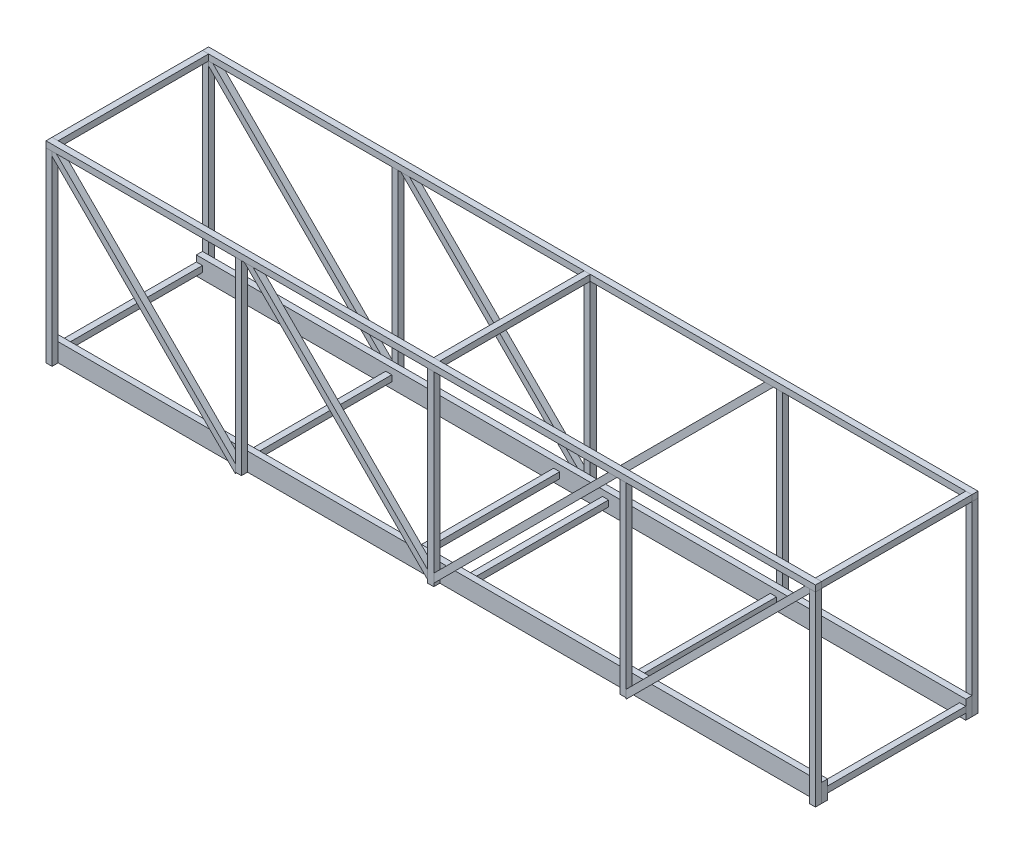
from build123d import *

# Parameters (mm, degrees)
SKETCH12_W                       = 3.175
SKETCH12_H                       = 9.525
STRUCTURAL_MEMBER1_DEPTH         = 400
SKETCH12_ON_SEGMENT_2_W          = 3.175
SKETCH12_ON_SEGMENT_2_H          = 9.525
STRUCTURAL_MEMBER1_2_DEPTH       = 400
SKETCH14_W                       = 3.175
SKETCH14_H                       = 3.175
STRUCTURAL_MEMBER2_DEPTH         = 75
SKETCH15_W                       = 3.175
SKETCH15_H                       = 3.175
STRUCTURAL_MEMBER3_DEPTH         = 75
SKETCH16_W                       = 3.175
SKETCH16_H                       = 3.175
STRUCTURAL_MEMBER4_DEPTH         = 75
SKETCH16_ON_SEGMENT_2_W          = 3.175
SKETCH16_ON_SEGMENT_2_H          = 3.175
STRUCTURAL_MEMBER4_2_DEPTH       = 75
SKETCH16_ON_SEGMENT_3_W          = 3.175
SKETCH16_ON_SEGMENT_3_H          = 3.175
STRUCTURAL_MEMBER4_3_DEPTH       = 75
SKETCH16_ON_SEGMENT_4_W          = 3.175
SKETCH16_ON_SEGMENT_4_H          = 3.175
STRUCTURAL_MEMBER4_4_DEPTH       = 75
SKETCH17_W                       = 3.175
SKETCH17_H                       = 3.175
STRUCTURAL_MEMBER5_DEPTH         = 100
SKETCH19_W                       = 3.175
SKETCH19_H                       = 3.175
STRUCTURAL_MEMBER6_DEPTH         = 100
SKETCH110_W                      = 3.175
SKETCH110_H                      = 3.175
STRUCTURAL_MEMBER7_DEPTH         = 100
SKETCH110_ON_SEGMENT_2_W         = 3.175
SKETCH110_ON_SEGMENT_2_H         = 3.175
STRUCTURAL_MEMBER7_2_DEPTH       = 100
SKETCH110_ON_SEGMENT_3_W         = 3.175
SKETCH110_ON_SEGMENT_3_H         = 3.175
STRUCTURAL_MEMBER7_3_DEPTH       = 100
SKETCH111_W                      = 3.175
SKETCH111_H                      = 3.175
STRUCTURAL_MEMBER8_DEPTH         = 400
SKETCH125_W                      = 3.175
SKETCH125_H                      = 3.175
STRUCTURAL_MEMBER15_DEPTH        = 100
SKETCH126_W                      = 3.175
SKETCH126_H                      = 3.175
STRUCTURAL_MEMBER16_DEPTH        = 100
SKETCH127_W                      = 3.175
SKETCH127_H                      = 3.175
STRUCTURAL_MEMBER17_DEPTH        = 100
SKETCH127_ON_SEGMENT_2_W         = 3.175
SKETCH127_ON_SEGMENT_2_H         = 3.175
STRUCTURAL_MEMBER17_2_DEPTH      = 100
SKETCH127_ON_SEGMENT_3_W         = 3.175
SKETCH127_ON_SEGMENT_3_H         = 3.175
STRUCTURAL_MEMBER17_3_DEPTH      = 100
SKETCH128_W                      = 3.175
SKETCH128_H                      = 3.175
STRUCTURAL_MEMBER18_DEPTH        = 400
SKETCH113_ON_SEGMENT_1_W         = 3.175
SKETCH113_ON_SEGMENT_1_H         = 3.175
STRUCTURAL_MEMBER9_DEPTH         = 142.421356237
SKETCH113_W                      = 3.175
SKETCH113_H                      = 3.175
STRUCTURAL_MEMBER9_2_DEPTH       = 141.421356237
BODY_START                       = 138.246356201
BODY_21_RUN_ON_DEPTH             = 76.130742
SKETCH130_ON_SEGMENT_1_W         = 3.175
SKETCH130_ON_SEGMENT_1_H         = 3.175
STRUCTURAL_MEMBER19_DEPTH        = 146.911484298
STRUCTURAL_MEMBER19_2_DEPTH      = 141.421356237
STRUCTURAL_MEMBER19_2_DEPTH_BACK = 5.490128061
SKETCH130_W                      = 3.175
SKETCH130_H                      = 3.175
SKETCH116_W                      = 3.175
SKETCH116_H                      = 3.175
STRUCTURAL_MEMBER10_DEPTH        = 141.421356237
BODY_25_RUN_ON_DEPTH             = 143.66642
SKETCH117_W                      = 3.175
SKETCH117_H                      = 3.175
STRUCTURAL_MEMBER11_DEPTH        = 141.421356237
SKETCH133_W                      = 3.175
SKETCH133_H                      = 3.175
STRUCTURAL_MEMBER21_DEPTH        = 141.421356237
BODY_27_RUN_ON_DEPTH             = 143.66642
SKETCH134_W                      = 3.175
SKETCH134_H                      = 3.175
STRUCTURAL_MEMBER22_DEPTH        = 141.421356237
SKETCH119_W                      = 3.175
SKETCH119_H                      = 3.175
STRUCTURAL_MEMBER12_DEPTH        = 78.175
SKETCH120_W                      = 3.175
SKETCH120_H                      = 3.175
STRUCTURAL_MEMBER13_DEPTH        = 78.175
SKETCH123_W                      = 3.175
SKETCH123_H                      = 3.175
STRUCTURAL_MEMBER14_DEPTH        = 78.175


with BuildPart() as part:
    # Sketch12 → Structural Member1 (new body)
    with BuildSketch(Plane(origin=(-200, 0, 37.5), x_dir=(0, 0, -1), z_dir=(1, 0, 0))):
        Rectangle(SKETCH12_W, SKETCH12_H)
    extrude(amount=STRUCTURAL_MEMBER1_DEPTH)


with BuildPart() as body_2:
    # Sketch12 on segment 2 (on carried to segment 2) → Structural Member1 2 (new body)
    with BuildSketch(Plane(origin=(-200, 0, -37.5), x_dir=(0, 0, -1), z_dir=(1, 0, 0))):
        Rectangle(SKETCH12_ON_SEGMENT_2_W, SKETCH12_ON_SEGMENT_2_H)
    extrude(amount=STRUCTURAL_MEMBER1_2_DEPTH)


with BuildPart() as body_3:
    # Sketch14 → Structural Member2 (new body)
    with BuildSketch(Plane(origin=(198.4125, 0, 37.5), x_dir=(-1, 0, 0), z_dir=(0, 0, -1))):
        Rectangle(SKETCH14_W, SKETCH14_H)
    extrude(amount=STRUCTURAL_MEMBER2_DEPTH)

    # Trim_Extend1 17: cut part
    add(part.part, mode=Mode.SUBTRACT)

    # Trim_Extend1 20
    split(bisect_by=Plane(origin=(0, 0, -35.9125), x_dir=(0, -1, 0), z_dir=(0, 0, 1)), keep=Keep.TOP)


with BuildPart() as body_4:
    # Sketch15 → Structural Member3 (new body)
    with BuildSketch(Plane(origin=(-198.4125, 0, 37.5), x_dir=(-1, 0, 0), z_dir=(0, 0, -1))):
        Rectangle(SKETCH15_W, SKETCH15_H)
    extrude(amount=STRUCTURAL_MEMBER3_DEPTH)

    # Trim_Extend1 17: cut part
    add(part.part, mode=Mode.SUBTRACT)

    # Trim_Extend1 34: cut body 2
    add(body_2.part, mode=Mode.SUBTRACT)


with BuildPart() as body_5:
    # Sketch16 → Structural Member4 (new body)
    with BuildSketch(Plane(origin=(-100, 0, -37.5), x_dir=(1, 0, 0), z_dir=(0, 0, 1))):
        Rectangle(SKETCH16_W, SKETCH16_H)
    extrude(amount=STRUCTURAL_MEMBER4_DEPTH)

    # Trim_Extend1
    split(bisect_by=Plane.YX.offset(-35.9125), keep=Keep.TOP)

    # Trim_Extend1 20
    split(bisect_by=Plane(origin=(0, 0, -35.9125), x_dir=(0, -1, 0), z_dir=(0, 0, 1)), keep=Keep.TOP)


with BuildPart() as body_6:
    # Sketch16 on segment 2 (on carried to segment 2) → Structural Member4 2 (new body)
    with BuildSketch(Plane(origin=(-12.7, 0, -37.5), x_dir=(1, 0, 0), z_dir=(0, 0, 1))):
        Rectangle(SKETCH16_ON_SEGMENT_2_W, SKETCH16_ON_SEGMENT_2_H)
    extrude(amount=STRUCTURAL_MEMBER4_2_DEPTH)

    # Trim_Extend1 17: cut part
    add(part.part, mode=Mode.SUBTRACT)

    # Trim_Extend1 34: cut body 2
    add(body_2.part, mode=Mode.SUBTRACT)


with BuildPart() as body_7:
    # Sketch16 on segment 3 (on carried to segment 3) → Structural Member4 3 (new body)
    with BuildSketch(Plane(origin=(12.7, 0, -37.5), x_dir=(1, 0, 0), z_dir=(0, 0, 1))):
        Rectangle(SKETCH16_ON_SEGMENT_3_W, SKETCH16_ON_SEGMENT_3_H)
    extrude(amount=STRUCTURAL_MEMBER4_3_DEPTH)

    # Trim_Extend1 17: cut part
    add(part.part, mode=Mode.SUBTRACT)

    # Trim_Extend1 34: cut body 2
    add(body_2.part, mode=Mode.SUBTRACT)


with BuildPart() as body_8:
    # Sketch16 on segment 4 (on carried to segment 4) → Structural Member4 4 (new body)
    with BuildSketch(Plane(origin=(100, 0, -37.5), x_dir=(1, 0, 0), z_dir=(0, 0, 1))):
        Rectangle(SKETCH16_ON_SEGMENT_4_W, SKETCH16_ON_SEGMENT_4_H)
    extrude(amount=STRUCTURAL_MEMBER4_4_DEPTH)

    # Trim_Extend1
    split(bisect_by=Plane.YX.offset(-35.9125), keep=Keep.TOP)

    # Trim_Extend1 20
    split(bisect_by=Plane(origin=(0, 0, -35.9125), x_dir=(0, -1, 0), z_dir=(0, 0, 1)), keep=Keep.TOP)


with BuildPart() as body_9:
    # Sketch17 → Structural Member5 (new body)
    with BuildSketch(Plane(origin=(-198.4125, -4.7625, 40.675), x_dir=(-1, 0, 0), z_dir=(0, 1, 0))):
        Rectangle(SKETCH17_W, SKETCH17_H)
    extrude(amount=STRUCTURAL_MEMBER5_DEPTH)


with BuildPart() as body_10:
    # Sketch19 → Structural Member6 (new body)
    with BuildSketch(Plane(origin=(198.4125, -4.7625, 40.675), x_dir=(-1, 0, 0), z_dir=(0, 1, 0))):
        Rectangle(SKETCH19_W, SKETCH19_H)
    extrude(amount=STRUCTURAL_MEMBER6_DEPTH)


with BuildPart() as body_11:
    # Sketch110 → Structural Member7 (new body)
    with BuildSketch(Plane(origin=(100, 95.2375, 40.675), x_dir=(1, 0, 0), z_dir=(0, -1, 0))):
        Rectangle(SKETCH110_W, SKETCH110_H)
    extrude(amount=STRUCTURAL_MEMBER7_DEPTH)

    # Trim_Extend2 7
    split(bisect_by=Plane(origin=(0, 92.0625, 40.675), x_dir=(1, 0, 0), z_dir=(0, -1, 0)), keep=Keep.TOP)


with BuildPart() as body_12:
    # Sketch110 on segment 2 (on carried to segment 2) → Structural Member7 2 (new body)
    with BuildSketch(Plane(origin=(0, 95.2375, 40.675), x_dir=(1, 0, 0), z_dir=(0, -1, 0))):
        Rectangle(SKETCH110_ON_SEGMENT_2_W, SKETCH110_ON_SEGMENT_2_H)
    extrude(amount=STRUCTURAL_MEMBER7_2_DEPTH)

    # Trim_Extend2 7
    split(bisect_by=Plane(origin=(0, 92.0625, 40.675), x_dir=(1, 0, 0), z_dir=(0, -1, 0)), keep=Keep.TOP)


with BuildPart() as body_13:
    # Sketch110 on segment 3 (on carried to segment 3) → Structural Member7 3 (new body)
    with BuildSketch(Plane(origin=(-100, 95.2375, 40.675), x_dir=(1, 0, 0), z_dir=(0, -1, 0))):
        Rectangle(SKETCH110_ON_SEGMENT_3_W, SKETCH110_ON_SEGMENT_3_H)
    extrude(amount=STRUCTURAL_MEMBER7_3_DEPTH)


with BuildPart() as body_14:
    # Sketch111 → Structural Member8 (new body)
    with BuildSketch(Plane(origin=(-200, 93.65, 40.675), x_dir=(0, 1, 0), z_dir=(1, 0, 0))):
        Rectangle(SKETCH111_W, SKETCH111_H)
    extrude(amount=STRUCTURAL_MEMBER8_DEPTH)


with BuildPart() as body_9_1:
    add(body_9.part)

    # Trim_Extend2 17: cut body 14
    add(body_14.part, mode=Mode.SUBTRACT)


with BuildPart() as body_13_1:
    add(body_13.part)

    # Trim_Extend2 17: cut body 14
    add(body_14.part, mode=Mode.SUBTRACT)


with BuildPart() as body_10_1:
    add(body_10.part)

    # Trim_Extend2 17: cut body 14
    add(body_14.part, mode=Mode.SUBTRACT)


with BuildPart() as body_15:
    # Sketch125 → Structural Member15 (new body)
    with BuildSketch(Plane(origin=(198.4125, -4.7625, -40.675), x_dir=(1, 0, 0), z_dir=(0, 1, 0))):
        Rectangle(SKETCH125_W, SKETCH125_H)
    extrude(amount=STRUCTURAL_MEMBER15_DEPTH)

    # Trim_Extend3 5
    split(bisect_by=Plane(origin=(0, 92.0625, -40.675), x_dir=(1, 0, 0), z_dir=(0, -1, 0)), keep=Keep.TOP)


with BuildPart() as body_16:
    # Sketch126 → Structural Member16 (new body)
    with BuildSketch(Plane(origin=(-198.4125, -4.7625, -40.675), x_dir=(1, 0, 0), z_dir=(0, 1, 0))):
        Rectangle(SKETCH126_W, SKETCH126_H)
    extrude(amount=STRUCTURAL_MEMBER16_DEPTH)


with BuildPart() as body_17:
    # Sketch127 → Structural Member17 (new body)
    with BuildSketch(Plane(origin=(100, -4.7625, -40.675), x_dir=(1, 0, 0), z_dir=(0, 1, 0))):
        Rectangle(SKETCH127_W, SKETCH127_H)
    extrude(amount=STRUCTURAL_MEMBER17_DEPTH)


with BuildPart() as body_18:
    # Sketch127 on segment 2 (on carried to segment 2) → Structural Member17 2 (new body)
    with BuildSketch(Plane(origin=(0, -4.7625, -40.675), x_dir=(1, 0, 0), z_dir=(0, 1, 0))):
        Rectangle(SKETCH127_ON_SEGMENT_2_W, SKETCH127_ON_SEGMENT_2_H)
    extrude(amount=STRUCTURAL_MEMBER17_2_DEPTH)

    # Trim_Extend3 5
    split(bisect_by=Plane(origin=(0, 92.0625, -40.675), x_dir=(1, 0, 0), z_dir=(0, -1, 0)), keep=Keep.TOP)


with BuildPart() as body_19:
    # Sketch127 on segment 3 (on carried to segment 3) → Structural Member17 3 (new body)
    with BuildSketch(Plane(origin=(-100, -4.7625, -40.675), x_dir=(1, 0, 0), z_dir=(0, 1, 0))):
        Rectangle(SKETCH127_ON_SEGMENT_3_W, SKETCH127_ON_SEGMENT_3_H)
    extrude(amount=STRUCTURAL_MEMBER17_3_DEPTH)

    # Trim_Extend3 5
    split(bisect_by=Plane(origin=(0, 92.0625, -40.675), x_dir=(1, 0, 0), z_dir=(0, -1, 0)), keep=Keep.TOP)


with BuildPart() as body_20:
    # Sketch128 → Structural Member18 (new body)
    with BuildSketch(Plane(origin=(-200, 93.65, -40.675), x_dir=(0, -1, 0), z_dir=(1, 0, 0))):
        Rectangle(SKETCH128_W, SKETCH128_H)
    extrude(amount=STRUCTURAL_MEMBER18_DEPTH)


with BuildPart() as body_17_1:
    add(body_17.part)

    # Trim_Extend3 17: cut body 20
    add(body_20.part, mode=Mode.SUBTRACT)


with BuildPart() as body_16_1:
    add(body_16.part)

    # Trim_Extend3 17: cut body 20
    add(body_20.part, mode=Mode.SUBTRACT)


with BuildPart() as body_21:
    # Sketch113 on segment 1 (on carried to segment 1) → Structural Member9 (new body)
    with BuildSketch(Plane(origin=(-98.877467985, 96.360032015, 40.675), x_dir=(0.707106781, 0.707106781, 0), z_dir=(0.707106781, -0.707106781, 0))):
        Rectangle(SKETCH113_ON_SEGMENT_1_W, SKETCH113_ON_SEGMENT_1_H)
    extrude(amount=STRUCTURAL_MEMBER9_DEPTH)

    # Structural Member9 end butt 1
    split(bisect_by=Plane(origin=(-2.24506403, -2.51743597, 39.0875), x_dir=(-0.707106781, -0.707106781, 0), z_dir=(-0.707106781, 0.707106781, 0)), keep=Keep.TOP)

    # Sketch113 on segment 1 (on carried to segment 1) → body 21 run on (add)
    with BuildSketch(Plane(origin=(-98.877467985, 96.360032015, 40.675), x_dir=(0.707106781, 0.707106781, 0), z_dir=(0.707106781, -0.707106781, 0)).offset(BODY_START)):
        Rectangle(SKETCH113_ON_SEGMENT_1_W, SKETCH113_ON_SEGMENT_1_H)
    extrude(amount=BODY_21_RUN_ON_DEPTH)

    # Trim_Extend6 7
    split(bisect_by=Plane(origin=(0, 92.0625, 40.675), x_dir=(1, 0, 0), z_dir=(0, -1, 0)), keep=Keep.TOP)

    # Trim_Extend6 24
    split(bisect_by=Plane(origin=(-1.5875, 43.65, 40.675), x_dir=(0, -1, 0), z_dir=(-1, 0, 0)), keep=Keep.TOP)


with BuildPart() as body_22:
    # Sketch113 → Structural Member9 2 (new body)
    with BuildSketch(Plane(origin=(-1.122532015, -3.639967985, 40.675), x_dir=(-0.707106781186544, 0.7071067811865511, 0), z_dir=(0.7071067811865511, 0.707106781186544, 0))):
        Rectangle(SKETCH113_W, SKETCH113_H)
    extrude(amount=STRUCTURAL_MEMBER9_2_DEPTH)

    # Trim_Extend6 7
    split(bisect_by=Plane(origin=(0, 92.0625, 40.675), x_dir=(1, 0, 0), z_dir=(0, -1, 0)), keep=Keep.TOP)

    # Trim_Extend6 22
    split(bisect_by=Plane(origin=(1.5875, 43.65, 40.675), x_dir=(0, 1, 0), z_dir=(1, 0, 0)), keep=Keep.TOP)


with BuildPart() as body_23:
    # Sketch130 on segment 1 (on carried to segment 1) → Structural Member19 (new body)
    with BuildSketch(Plane(origin=(-98.877467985, 96.360032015, -40.675), x_dir=(-0.707106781, -0.707106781, 0), z_dir=(0.707106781, -0.707106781, 0))):
        Rectangle(SKETCH130_ON_SEGMENT_1_W, SKETCH130_ON_SEGMENT_1_H)
    extrude(amount=STRUCTURAL_MEMBER19_DEPTH)

    # Structural Member19 mitre 1
    split(bisect_by=Plane(origin=(0, -4.7625, -39.0875), x_dir=(0, -1, 0), z_dir=(-1, 0, 0)), keep=Keep.TOP)

    # Trim_Extend17 5
    split(bisect_by=Plane(origin=(0, 92.0625, -40.675), x_dir=(1, 0, 0), z_dir=(0, -1, 0)), keep=Keep.TOP)

    # Trim_Extend17 24
    split(bisect_by=Plane(origin=(-1.5875, 43.65, -40.675), x_dir=(0, -1, 0), z_dir=(-1, 0, 0)), keep=Keep.TOP)


with BuildPart() as body_24:
    # Sketch130 → Structural Member19 2 (new, two sides: drawn at the far end of the back side and taken through both)
    with BuildSketch(Plane(origin=(-1.122532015, -3.639967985, -40.675), x_dir=(0.7071067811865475, -0.7071067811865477, 0), z_dir=(0.7071067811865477, 0.7071067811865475, 0)).offset(-STRUCTURAL_MEMBER19_2_DEPTH_BACK)):
        Rectangle(SKETCH130_W, SKETCH130_H)
    extrude(amount=STRUCTURAL_MEMBER19_2_DEPTH + STRUCTURAL_MEMBER19_2_DEPTH_BACK)

    # Structural Member19 2 mitre 1
    split(bisect_by=Plane(origin=(0, -4.7625, -39.0875), x_dir=(0, 1, 0), z_dir=(1, 0, 0)), keep=Keep.TOP)

    # Trim_Extend17 5
    split(bisect_by=Plane(origin=(0, 92.0625, -40.675), x_dir=(1, 0, 0), z_dir=(0, -1, 0)), keep=Keep.TOP)

    # Trim_Extend17 34: cut body 18
    add(body_18.part, mode=Mode.SUBTRACT)


with BuildPart() as body_25:
    # Sketch116 → Structural Member10 (new body)
    with BuildSketch(Plane(origin=(100, -4.7625, 40.675), x_dir=(-0.7071067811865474, 0.7071067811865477, 0), z_dir=(0.7071067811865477, 0.7071067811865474, 0))):
        Rectangle(SKETCH116_W, SKETCH116_H)
    extrude(amount=STRUCTURAL_MEMBER10_DEPTH)

    # Sketch116 → body 25 run on (add)
    with BuildSketch(Plane(origin=(100, -4.7625, 40.675), x_dir=(-0.7071067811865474, 0.7071067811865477, 0), z_dir=(0.7071067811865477, 0.7071067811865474, 0))):
        Rectangle(SKETCH116_W, SKETCH116_H)
    extrude(amount=-BODY_25_RUN_ON_DEPTH)

    # Trim_Extend8 5
    split(bisect_by=Plane(origin=(101.5875, 43.65, 40.675), x_dir=(0, 1, 0), z_dir=(1, 0, 0)), keep=Keep.TOP)

    # Trim_Extend8 24
    split(bisect_by=Plane(origin=(0, 92.0625, 40.675), x_dir=(1, 0, 0), z_dir=(0, -1, 0)), keep=Keep.TOP)

    # Trim_Extend8 39
    split(bisect_by=Plane(origin=(196.825, 43.65, 40.675), x_dir=(0, -1, 0), z_dir=(-1, 0, 0)), keep=Keep.TOP)


with BuildPart() as body_26:
    # Sketch117 → Structural Member11 (new body)
    with BuildSketch(Plane(origin=(-200, 95.2375, 40.675), x_dir=(0.7071067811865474, 0.7071067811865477, 0), z_dir=(0.7071067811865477, -0.7071067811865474, 0))):
        Rectangle(SKETCH117_W, SKETCH117_H)
    extrude(amount=STRUCTURAL_MEMBER11_DEPTH)

    # Trim_Extend16 7
    split(bisect_by=Plane(origin=(-101.5875, 43.65, 40.675), x_dir=(0, -1, 0), z_dir=(-1, 0, 0)), keep=Keep.TOP)

    # Trim_Extend15 7
    split(bisect_by=Plane(origin=(0, 92.0625, 40.675), x_dir=(1, 0, 0), z_dir=(0, -1, 0)), keep=Keep.TOP)

    # Trim_Extend15 34: cut body 9
    add(body_9_1.part, mode=Mode.SUBTRACT)


with BuildPart() as body_27:
    # Sketch133 → Structural Member21 (new body)
    with BuildSketch(Plane(origin=(-100, -4.7625, -40.675), x_dir=(0.7071067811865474, 0.7071067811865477, 0), z_dir=(-0.7071067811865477, 0.7071067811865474, 0))):
        Rectangle(SKETCH133_W, SKETCH133_H)
    extrude(amount=STRUCTURAL_MEMBER21_DEPTH)

    # Sketch133 → body 27 run on (add)
    with BuildSketch(Plane(origin=(-100, -4.7625, -40.675), x_dir=(0.7071067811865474, 0.7071067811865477, 0), z_dir=(-0.7071067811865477, 0.7071067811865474, 0))):
        Rectangle(SKETCH133_W, SKETCH133_H)
    extrude(amount=-BODY_27_RUN_ON_DEPTH)

    # Trim_Extend13 7
    split(bisect_by=Plane(origin=(-101.5875, 43.65, -40.675), x_dir=(0, -1, 0), z_dir=(-1, 0, 0)), keep=Keep.TOP)

    # Trim_Extend13 22
    split(bisect_by=Plane(origin=(0, 92.0625, -40.675), x_dir=(1, 0, 0), z_dir=(0, -1, 0)), keep=Keep.TOP)

    # Trim_Extend13 39
    split(bisect_by=Plane(origin=(-196.825, 43.65, -40.675), x_dir=(0, 1, 0), z_dir=(1, 0, 0)), keep=Keep.TOP)


with BuildPart() as body_28:
    # Sketch134 → Structural Member22 (new body)
    with BuildSketch(Plane(origin=(100, -4.7625, -40.675), x_dir=(0.7071067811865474, -0.7071067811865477, 0), z_dir=(0.7071067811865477, 0.7071067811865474, 0))):
        Rectangle(SKETCH134_W, SKETCH134_H)
    extrude(amount=STRUCTURAL_MEMBER22_DEPTH)

    # Trim_Extend14 7
    split(bisect_by=Plane(origin=(196.825, 43.65, -40.675), x_dir=(0, -1, 0), z_dir=(-1, 0, 0)), keep=Keep.TOP)

    # Trim_Extend14 34: cut body 20
    add(body_20.part, mode=Mode.SUBTRACT)

    # Trim_Extend14 39
    split(bisect_by=Plane(origin=(101.5875, 43.65, -40.675), x_dir=(0, 1, 0), z_dir=(1, 0, 0)), keep=Keep.TOP)


with BuildPart() as body_29:
    # Sketch119 → Structural Member12 (new body)
    with BuildSketch(Plane(origin=(198.4125, 93.65, 39.0875), x_dir=(-1, 0, 0), z_dir=(0, 0, -1))):
        Rectangle(SKETCH119_W, SKETCH119_H)
    extrude(amount=STRUCTURAL_MEMBER12_DEPTH)


with BuildPart() as body_30:
    # Sketch120 → Structural Member13 (new body)
    with BuildSketch(Plane(origin=(-198.4125, 93.65, 39.0875), x_dir=(-1, 0, 0), z_dir=(0, 0, -1))):
        Rectangle(SKETCH120_W, SKETCH120_H)
    extrude(amount=STRUCTURAL_MEMBER13_DEPTH)


with BuildPart() as body_31:
    # Sketch123 → Structural Member14 (new body)
    with BuildSketch(Plane(origin=(0, 93.65, 39.0875), x_dir=(-1, 0, 0), z_dir=(0, 0, -1))):
        Rectangle(SKETCH123_W, SKETCH123_H)
    extrude(amount=STRUCTURAL_MEMBER14_DEPTH)


solid = Compound([part.part, body_2.part, body_3.part, body_4.part, body_5.part, body_6.part, body_7.part, body_8.part, body_11.part, body_12.part, body_14.part, body_9_1.part, body_13_1.part, body_10_1.part, body_15.part, body_18.part, body_19.part, body_20.part, body_17_1.part, body_16_1.part, body_21.part, body_22.part, body_23.part, body_24.part, body_25.part, body_26.part, body_27.part, body_28.part, body_29.part, body_30.part, body_31.part])
